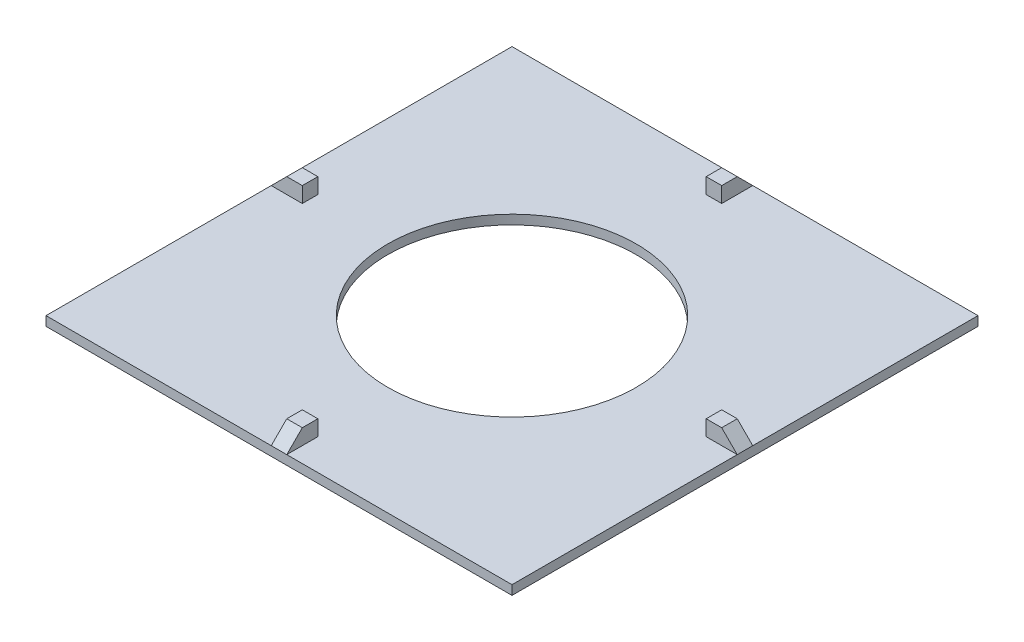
ISO-10303-21;
HEADER;
FILE_DESCRIPTION(('STEP AP214'),'2;1');
FILE_NAME('part.step','',(''),(''),'','','');
FILE_SCHEMA(('AUTOMOTIVE_DESIGN { 1 0 10303 214 1 1 1 1 }'));
ENDSEC;
DATA;
#1=APPLICATION_CONTEXT('core data for automotive mechanical design processes');
#2=APPLICATION_PROTOCOL_DEFINITION('international standard','automotive_design',2000,#1);
#3=PRODUCT_CONTEXT('',#1,'mechanical');
#4=PRODUCT('Part','Part','',(#3));
#5=PRODUCT_RELATED_PRODUCT_CATEGORY('part','',(#4));
#6=PRODUCT_DEFINITION_FORMATION('','',#4);
#7=PRODUCT_DEFINITION_CONTEXT('part definition',#1,'design');
#8=PRODUCT_DEFINITION('design','',#6,#7);
#9=PRODUCT_DEFINITION_SHAPE('','',#8);
#10=(LENGTH_UNIT() NAMED_UNIT(*) SI_UNIT(.MILLI.,.METRE.));
#11=(NAMED_UNIT(*) PLANE_ANGLE_UNIT() SI_UNIT($,.RADIAN.));
#12=(NAMED_UNIT(*) SI_UNIT($,.STERADIAN.) SOLID_ANGLE_UNIT());
#13=UNCERTAINTY_MEASURE_WITH_UNIT(LENGTH_MEASURE(1.E-05),#10,'distance_accuracy_value','');
#14=(GEOMETRIC_REPRESENTATION_CONTEXT(3) GLOBAL_UNCERTAINTY_ASSIGNED_CONTEXT((#13)) GLOBAL_UNIT_ASSIGNED_CONTEXT((#10,
#11,#12)) REPRESENTATION_CONTEXT('',''));
#15=CARTESIAN_POINT('',(0.,0.,0.));
#16=DIRECTION('',(0.,0.,1.));
#17=DIRECTION('',(1.,0.,0.));
#18=AXIS2_PLACEMENT_3D('',#15,#16,#17);
#19=CARTESIAN_POINT('',(0.,1.5,0.));
#20=DIRECTION('',(0.,1.,0.));
#21=DIRECTION('',(0.,0.,1.));
#22=AXIS2_PLACEMENT_3D('',#19,#20,#21);
#23=PLANE('',#22);
#24=CARTESIAN_POINT('',(0.,1.5,0.));
#25=DIRECTION('',(0.,1.,0.));
#26=DIRECTION('',(0.,0.,1.));
#27=AXIS2_PLACEMENT_3D('',#24,#25,#26);
#28=CIRCLE('',#27,40.);
#29=CARTESIAN_POINT('',(0.,1.5,40.));
#30=VERTEX_POINT('',#29);
#31=EDGE_CURVE('E258',#30,#30,#28,.T.);
#32=ORIENTED_EDGE('',*,*,#31,.F.);
#33=EDGE_LOOP('',(#32));
#34=FACE_BOUND('',#33,.T.);
#35=DIRECTION('',(-1.,0.,0.));
#36=VECTOR('',#35,1.);
#37=CARTESIAN_POINT('',(-2.49999999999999,1.5,65.));
#38=LINE('',#37,#36);
#39=CARTESIAN_POINT('',(2.50000000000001,1.5,65.));
#40=VERTEX_POINT('',#39);
#41=CARTESIAN_POINT('',(-2.49999999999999,1.5,65.));
#42=VERTEX_POINT('',#41);
#43=EDGE_CURVE('E207',#40,#42,#38,.T.);
#44=ORIENTED_EDGE('',*,*,#43,.F.);
#45=DIRECTION('',(0.,0.,-1.));
#46=VECTOR('',#45,1.);
#47=CARTESIAN_POINT('',(2.5,1.5,75.));
#48=LINE('',#47,#46);
#49=CARTESIAN_POINT('',(2.5,1.5,75.));
#50=VERTEX_POINT('',#49);
#51=EDGE_CURVE('E187',#50,#40,#48,.T.);
#52=ORIENTED_EDGE('',*,*,#51,.F.);
#53=DIRECTION('',(1.,0.,0.));
#54=VECTOR('',#53,1.);
#55=CARTESIAN_POINT('',(-75.,1.5,75.));
#56=LINE('',#55,#54);
#57=CARTESIAN_POINT('',(75.,1.5,75.));
#58=VERTEX_POINT('',#57);
#59=EDGE_CURVE('E194',#50,#58,#56,.T.);
#60=ORIENTED_EDGE('',*,*,#59,.T.);
#61=DIRECTION('',(0.,0.,-1.));
#62=VECTOR('',#61,1.);
#63=CARTESIAN_POINT('',(75.,1.5,-75.));
#64=LINE('',#63,#62);
#65=CARTESIAN_POINT('',(75.,1.5,2.5));
#66=VERTEX_POINT('',#65);
#67=EDGE_CURVE('E267',#58,#66,#64,.T.);
#68=ORIENTED_EDGE('',*,*,#67,.T.);
#69=DIRECTION('',(1.,0.,0.));
#70=VECTOR('',#69,1.);
#71=CARTESIAN_POINT('',(65.,1.5,2.5));
#72=LINE('',#71,#70);
#73=CARTESIAN_POINT('',(65.,1.5,2.5));
#74=VERTEX_POINT('',#73);
#75=EDGE_CURVE('E285',#74,#66,#72,.T.);
#76=ORIENTED_EDGE('',*,*,#75,.F.);
#77=DIRECTION('',(0.,0.,1.));
#78=VECTOR('',#77,1.);
#79=CARTESIAN_POINT('',(65.,1.5,-2.5));
#80=LINE('',#79,#78);
#81=CARTESIAN_POINT('',(65.,1.5,-2.5));
#82=VERTEX_POINT('',#81);
#83=EDGE_CURVE('E288',#82,#74,#80,.T.);
#84=ORIENTED_EDGE('',*,*,#83,.F.);
#85=DIRECTION('',(-1.,0.,0.));
#86=VECTOR('',#85,1.);
#87=CARTESIAN_POINT('',(65.,1.5,-2.5));
#88=LINE('',#87,#86);
#89=CARTESIAN_POINT('',(75.,1.5,-2.5));
#90=VERTEX_POINT('',#89);
#91=EDGE_CURVE('E281',#90,#82,#88,.T.);
#92=ORIENTED_EDGE('',*,*,#91,.F.);
#93=CARTESIAN_POINT('',(75.,1.5,-75.));
#94=VERTEX_POINT('',#93);
#95=EDGE_CURVE('E251',#90,#94,#64,.T.);
#96=ORIENTED_EDGE('',*,*,#95,.T.);
#97=DIRECTION('',(-1.,0.,0.));
#98=VECTOR('',#97,1.);
#99=CARTESIAN_POINT('',(-75.,1.5,-75.));
#100=LINE('',#99,#98);
#101=CARTESIAN_POINT('',(2.5,1.5,-75.));
#102=VERTEX_POINT('',#101);
#103=EDGE_CURVE('E263',#94,#102,#100,.T.);
#104=ORIENTED_EDGE('',*,*,#103,.T.);
#105=DIRECTION('',(0.,0.,-1.));
#106=VECTOR('',#105,1.);
#107=CARTESIAN_POINT('',(2.5,1.5,-75.));
#108=LINE('',#107,#106);
#109=CARTESIAN_POINT('',(2.50000000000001,1.5,-65.));
#110=VERTEX_POINT('',#109);
#111=EDGE_CURVE('E322',#110,#102,#108,.T.);
#112=ORIENTED_EDGE('',*,*,#111,.F.);
#113=DIRECTION('',(1.,0.,0.));
#114=VECTOR('',#113,1.);
#115=CARTESIAN_POINT('',(-2.49999999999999,1.5,-65.));
#116=LINE('',#115,#114);
#117=CARTESIAN_POINT('',(-2.49999999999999,1.5,-65.));
#118=VERTEX_POINT('',#117);
#119=EDGE_CURVE('E331',#118,#110,#116,.T.);
#120=ORIENTED_EDGE('',*,*,#119,.F.);
#121=DIRECTION('',(0.,0.,1.));
#122=VECTOR('',#121,1.);
#123=CARTESIAN_POINT('',(-2.5,1.5,-75.));
#124=LINE('',#123,#122);
#125=CARTESIAN_POINT('',(-2.5,1.5,-75.));
#126=VERTEX_POINT('',#125);
#127=EDGE_CURVE('E319',#126,#118,#124,.T.);
#128=ORIENTED_EDGE('',*,*,#127,.F.);
#129=CARTESIAN_POINT('',(-75.,1.5,-75.));
#130=VERTEX_POINT('',#129);
#131=EDGE_CURVE('E266',#126,#130,#100,.T.);
#132=ORIENTED_EDGE('',*,*,#131,.T.);
#133=DIRECTION('',(0.,0.,1.));
#134=VECTOR('',#133,1.);
#135=CARTESIAN_POINT('',(-75.,1.5,-75.));
#136=LINE('',#135,#134);
#137=CARTESIAN_POINT('',(-75.,1.5,-2.5));
#138=VERTEX_POINT('',#137);
#139=EDGE_CURVE('E204',#130,#138,#136,.T.);
#140=ORIENTED_EDGE('',*,*,#139,.T.);
#141=DIRECTION('',(-1.,0.,0.));
#142=VECTOR('',#141,1.);
#143=CARTESIAN_POINT('',(-75.,1.5,-2.5));
#144=LINE('',#143,#142);
#145=CARTESIAN_POINT('',(-65.,1.5,-2.5));
#146=VERTEX_POINT('',#145);
#147=EDGE_CURVE('E300',#146,#138,#144,.T.);
#148=ORIENTED_EDGE('',*,*,#147,.F.);
#149=DIRECTION('',(0.,0.,-1.));
#150=VECTOR('',#149,1.);
#151=CARTESIAN_POINT('',(-65.,1.5,2.5));
#152=LINE('',#151,#150);
#153=CARTESIAN_POINT('',(-65.,1.5,2.5));
#154=VERTEX_POINT('',#153);
#155=EDGE_CURVE('E309',#154,#146,#152,.T.);
#156=ORIENTED_EDGE('',*,*,#155,.F.);
#157=DIRECTION('',(1.,0.,0.));
#158=VECTOR('',#157,1.);
#159=CARTESIAN_POINT('',(-75.,1.5,2.5));
#160=LINE('',#159,#158);
#161=CARTESIAN_POINT('',(-75.,1.5,2.5));
#162=VERTEX_POINT('',#161);
#163=EDGE_CURVE('E291',#162,#154,#160,.T.);
#164=ORIENTED_EDGE('',*,*,#163,.F.);
#165=CARTESIAN_POINT('',(-75.,1.5,75.));
#166=VERTEX_POINT('',#165);
#167=EDGE_CURVE('E262',#162,#166,#136,.T.);
#168=ORIENTED_EDGE('',*,*,#167,.T.);
#169=CARTESIAN_POINT('',(-2.5,1.5,75.));
#170=VERTEX_POINT('',#169);
#171=EDGE_CURVE('E203',#166,#170,#56,.T.);
#172=ORIENTED_EDGE('',*,*,#171,.T.);
#173=DIRECTION('',(0.,0.,1.));
#174=VECTOR('',#173,1.);
#175=CARTESIAN_POINT('',(-2.5,1.5,75.));
#176=LINE('',#175,#174);
#177=EDGE_CURVE('E341',#42,#170,#176,.T.);
#178=ORIENTED_EDGE('',*,*,#177,.F.);
#179=EDGE_LOOP('',(#44,#52,#60,#68,#76,#84,#92,#96,#104,#112,#120,#128,#132,#140,#148,#156,#164,
#168,#172,#178));
#180=FACE_BOUND('',#179,.T.);
#181=ADVANCED_FACE('F44',(#34,#180),#23,.T.);
#182=CARTESIAN_POINT('',(0.,-1.5,0.));
#183=DIRECTION('',(0.,1.,0.));
#184=DIRECTION('',(0.,0.,1.));
#185=AXIS2_PLACEMENT_3D('',#182,#183,#184);
#186=PLANE('',#185);
#187=DIRECTION('',(0.,0.,-1.));
#188=VECTOR('',#187,1.);
#189=CARTESIAN_POINT('',(75.,-1.5,-75.));
#190=LINE('',#189,#188);
#191=CARTESIAN_POINT('',(75.,-1.5,75.));
#192=VERTEX_POINT('',#191);
#193=CARTESIAN_POINT('',(75.,-1.5,-75.));
#194=VERTEX_POINT('',#193);
#195=EDGE_CURVE('E256',#192,#194,#190,.T.);
#196=ORIENTED_EDGE('',*,*,#195,.F.);
#197=DIRECTION('',(1.,0.,0.));
#198=VECTOR('',#197,1.);
#199=CARTESIAN_POINT('',(-75.,-1.5,75.));
#200=LINE('',#199,#198);
#201=CARTESIAN_POINT('',(-75.,-1.5,75.));
#202=VERTEX_POINT('',#201);
#203=EDGE_CURVE('E249',#202,#192,#200,.T.);
#204=ORIENTED_EDGE('',*,*,#203,.F.);
#205=DIRECTION('',(0.,0.,1.));
#206=VECTOR('',#205,1.);
#207=CARTESIAN_POINT('',(-75.,-1.5,-75.));
#208=LINE('',#207,#206);
#209=CARTESIAN_POINT('',(-75.,-1.5,-75.));
#210=VERTEX_POINT('',#209);
#211=EDGE_CURVE('E252',#210,#202,#208,.T.);
#212=ORIENTED_EDGE('',*,*,#211,.F.);
#213=DIRECTION('',(-1.,0.,0.));
#214=VECTOR('',#213,1.);
#215=CARTESIAN_POINT('',(-75.,-1.5,-75.));
#216=LINE('',#215,#214);
#217=EDGE_CURVE('E254',#194,#210,#216,.T.);
#218=ORIENTED_EDGE('',*,*,#217,.F.);
#219=EDGE_LOOP('',(#196,#204,#212,#218));
#220=FACE_BOUND('',#219,.T.);
#221=CARTESIAN_POINT('',(0.,-1.5,0.));
#222=DIRECTION('',(0.,1.,0.));
#223=DIRECTION('',(0.,0.,1.));
#224=AXIS2_PLACEMENT_3D('',#221,#222,#223);
#225=CIRCLE('',#224,40.);
#226=CARTESIAN_POINT('',(0.,-1.5,40.));
#227=VERTEX_POINT('',#226);
#228=EDGE_CURVE('E269',#227,#227,#225,.T.);
#229=ORIENTED_EDGE('',*,*,#228,.T.);
#230=EDGE_LOOP('',(#229));
#231=FACE_BOUND('',#230,.T.);
#232=ADVANCED_FACE('F367',(#220,#231),#186,.F.);
#233=CARTESIAN_POINT('',(75.,1.5,-75.));
#234=DIRECTION('',(-1.,0.,0.));
#235=DIRECTION('',(0.,0.,1.));
#236=AXIS2_PLACEMENT_3D('',#233,#234,#235);
#237=PLANE('',#236);
#238=ORIENTED_EDGE('',*,*,#95,.F.);
#239=DIRECTION('',(0.,0.,1.));
#240=VECTOR('',#239,1.);
#241=CARTESIAN_POINT('',(75.,1.50000000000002,2.5));
#242=LINE('',#241,#240);
#243=EDGE_CURVE('E214',#90,#66,#242,.T.);
#244=ORIENTED_EDGE('',*,*,#243,.T.);
#245=ORIENTED_EDGE('',*,*,#67,.F.);
#246=DIRECTION('',(0.,-1.,0.));
#247=VECTOR('',#246,1.);
#248=CARTESIAN_POINT('',(75.,1.5,75.));
#249=LINE('',#248,#247);
#250=EDGE_CURVE('E199',#58,#192,#249,.T.);
#251=ORIENTED_EDGE('',*,*,#250,.T.);
#252=ORIENTED_EDGE('',*,*,#195,.T.);
#253=DIRECTION('',(0.,-1.,0.));
#254=VECTOR('',#253,1.);
#255=CARTESIAN_POINT('',(75.,1.5,-75.));
#256=LINE('',#255,#254);
#257=EDGE_CURVE('E239',#94,#194,#256,.T.);
#258=ORIENTED_EDGE('',*,*,#257,.F.);
#259=EDGE_LOOP('',(#238,#244,#245,#251,#252,#258));
#260=FACE_BOUND('',#259,.T.);
#261=ADVANCED_FACE('F372',(#260),#237,.F.);
#262=CARTESIAN_POINT('',(-75.,1.5,-75.));
#263=DIRECTION('',(0.,0.,1.));
#264=DIRECTION('',(1.,0.,0.));
#265=AXIS2_PLACEMENT_3D('',#262,#263,#264);
#266=PLANE('',#265);
#267=ORIENTED_EDGE('',*,*,#131,.F.);
#268=DIRECTION('',(1.,0.,0.));
#269=VECTOR('',#268,1.);
#270=CARTESIAN_POINT('',(2.5,1.5,-75.));
#271=LINE('',#270,#269);
#272=EDGE_CURVE('E223',#126,#102,#271,.T.);
#273=ORIENTED_EDGE('',*,*,#272,.T.);
#274=ORIENTED_EDGE('',*,*,#103,.F.);
#275=ORIENTED_EDGE('',*,*,#257,.T.);
#276=ORIENTED_EDGE('',*,*,#217,.T.);
#277=DIRECTION('',(0.,-1.,0.));
#278=VECTOR('',#277,1.);
#279=CARTESIAN_POINT('',(-75.,1.5,-75.));
#280=LINE('',#279,#278);
#281=EDGE_CURVE('E242',#130,#210,#280,.T.);
#282=ORIENTED_EDGE('',*,*,#281,.F.);
#283=EDGE_LOOP('',(#267,#273,#274,#275,#276,#282));
#284=FACE_BOUND('',#283,.T.);
#285=ADVANCED_FACE('F394',(#284),#266,.F.);
#286=CARTESIAN_POINT('',(-75.,1.5,-75.));
#287=DIRECTION('',(1.,0.,0.));
#288=DIRECTION('',(0.,0.,-1.));
#289=AXIS2_PLACEMENT_3D('',#286,#287,#288);
#290=PLANE('',#289);
#291=ORIENTED_EDGE('',*,*,#167,.F.);
#292=DIRECTION('',(0.,0.,-1.));
#293=VECTOR('',#292,1.);
#294=CARTESIAN_POINT('',(-75.,1.49999999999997,-75.));
#295=LINE('',#294,#293);
#296=EDGE_CURVE('E232',#162,#138,#295,.T.);
#297=ORIENTED_EDGE('',*,*,#296,.T.);
#298=ORIENTED_EDGE('',*,*,#139,.F.);
#299=ORIENTED_EDGE('',*,*,#281,.T.);
#300=ORIENTED_EDGE('',*,*,#211,.T.);
#301=DIRECTION('',(0.,-1.,0.));
#302=VECTOR('',#301,1.);
#303=CARTESIAN_POINT('',(-75.,1.5,75.));
#304=LINE('',#303,#302);
#305=EDGE_CURVE('E245',#166,#202,#304,.T.);
#306=ORIENTED_EDGE('',*,*,#305,.F.);
#307=EDGE_LOOP('',(#291,#297,#298,#299,#300,#306));
#308=FACE_BOUND('',#307,.T.);
#309=ADVANCED_FACE('F441',(#308),#290,.F.);
#310=CARTESIAN_POINT('',(-75.,1.5,75.));
#311=DIRECTION('',(0.,0.,-1.));
#312=DIRECTION('',(-1.,0.,0.));
#313=AXIS2_PLACEMENT_3D('',#310,#311,#312);
#314=PLANE('',#313);
#315=ORIENTED_EDGE('',*,*,#59,.F.);
#316=DIRECTION('',(-1.,0.,0.));
#317=VECTOR('',#316,1.);
#318=CARTESIAN_POINT('',(-2.5,1.49999999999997,75.));
#319=LINE('',#318,#317);
#320=EDGE_CURVE('E53',#50,#170,#319,.T.);
#321=ORIENTED_EDGE('',*,*,#320,.T.);
#322=ORIENTED_EDGE('',*,*,#171,.F.);
#323=ORIENTED_EDGE('',*,*,#305,.T.);
#324=ORIENTED_EDGE('',*,*,#203,.T.);
#325=ORIENTED_EDGE('',*,*,#250,.F.);
#326=EDGE_LOOP('',(#315,#321,#322,#323,#324,#325));
#327=FACE_BOUND('',#326,.T.);
#328=ADVANCED_FACE('F195',(#327),#314,.F.);
#329=CARTESIAN_POINT('',(0.,1.5,0.));
#330=DIRECTION('',(0.,-1.,0.));
#331=DIRECTION('',(0.,0.,-1.));
#332=AXIS2_PLACEMENT_3D('',#329,#330,#331);
#333=CYLINDRICAL_SURFACE('',#332,40.);
#334=ORIENTED_EDGE('',*,*,#31,.T.);
#335=EDGE_LOOP('',(#334));
#336=FACE_BOUND('',#335,.T.);
#337=ORIENTED_EDGE('',*,*,#228,.F.);
#338=EDGE_LOOP('',(#337));
#339=FACE_BOUND('',#338,.T.);
#340=ADVANCED_FACE('F436',(#336,#339),#333,.F.);
#341=CARTESIAN_POINT('',(65.,6.5,-2.5));
#342=DIRECTION('',(1.,0.,0.));
#343=DIRECTION('',(0.,0.,-1.));
#344=AXIS2_PLACEMENT_3D('',#341,#342,#343);
#345=PLANE('',#344);
#346=ORIENTED_EDGE('',*,*,#83,.T.);
#347=DIRECTION('',(0.,-1.,0.));
#348=VECTOR('',#347,1.);
#349=CARTESIAN_POINT('',(65.,6.5,2.5));
#350=LINE('',#349,#348);
#351=CARTESIAN_POINT('',(65.,6.5,2.5));
#352=VERTEX_POINT('',#351);
#353=EDGE_CURVE('E272',#352,#74,#350,.T.);
#354=ORIENTED_EDGE('',*,*,#353,.F.);
#355=DIRECTION('',(0.,0.,1.));
#356=VECTOR('',#355,1.);
#357=CARTESIAN_POINT('',(65.,6.5,-2.5));
#358=LINE('',#357,#356);
#359=CARTESIAN_POINT('',(65.,6.5,-2.5));
#360=VERTEX_POINT('',#359);
#361=EDGE_CURVE('E284',#360,#352,#358,.T.);
#362=ORIENTED_EDGE('',*,*,#361,.F.);
#363=DIRECTION('',(0.,-1.,0.));
#364=VECTOR('',#363,1.);
#365=CARTESIAN_POINT('',(65.,6.5,-2.5));
#366=LINE('',#365,#364);
#367=EDGE_CURVE('E277',#360,#82,#366,.T.);
#368=ORIENTED_EDGE('',*,*,#367,.T.);
#369=EDGE_LOOP('',(#346,#354,#362,#368));
#370=FACE_BOUND('',#369,.T.);
#371=ADVANCED_FACE('F390',(#370),#345,.F.);
#372=CARTESIAN_POINT('',(65.,6.5,2.5));
#373=DIRECTION('',(0.,0.,-1.));
#374=DIRECTION('',(-1.,0.,0.));
#375=AXIS2_PLACEMENT_3D('',#372,#373,#374);
#376=PLANE('',#375);
#377=ORIENTED_EDGE('',*,*,#75,.T.);
#378=DIRECTION('',(-0.707106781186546,0.707106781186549,0.));
#379=VECTOR('',#378,1.);
#380=CARTESIAN_POINT('',(70.0000000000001,6.5,2.5));
#381=LINE('',#380,#379);
#382=CARTESIAN_POINT('',(70.0000000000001,6.5,2.5));
#383=VERTEX_POINT('',#382);
#384=EDGE_CURVE('E212',#66,#383,#381,.T.);
#385=ORIENTED_EDGE('',*,*,#384,.T.);
#386=DIRECTION('',(1.,0.,0.));
#387=VECTOR('',#386,1.);
#388=CARTESIAN_POINT('',(65.,6.5,2.5));
#389=LINE('',#388,#387);
#390=EDGE_CURVE('E293',#352,#383,#389,.T.);
#391=ORIENTED_EDGE('',*,*,#390,.F.);
#392=ORIENTED_EDGE('',*,*,#353,.T.);
#393=EDGE_LOOP('',(#377,#385,#391,#392));
#394=FACE_BOUND('',#393,.T.);
#395=ADVANCED_FACE('F376',(#394),#376,.F.);
#396=CARTESIAN_POINT('',(65.,6.5,-2.5));
#397=DIRECTION('',(0.,0.,1.));
#398=DIRECTION('',(1.,0.,0.));
#399=AXIS2_PLACEMENT_3D('',#396,#397,#398);
#400=PLANE('',#399);
#401=DIRECTION('',(-1.,0.,0.));
#402=VECTOR('',#401,1.);
#403=CARTESIAN_POINT('',(65.,6.5,-2.5));
#404=LINE('',#403,#402);
#405=CARTESIAN_POINT('',(70.0000000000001,6.5,-2.5));
#406=VERTEX_POINT('',#405);
#407=EDGE_CURVE('E280',#406,#360,#404,.T.);
#408=ORIENTED_EDGE('',*,*,#407,.F.);
#409=DIRECTION('',(0.707106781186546,-0.707106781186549,0.));
#410=VECTOR('',#409,1.);
#411=CARTESIAN_POINT('',(70.0000000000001,6.5,-2.5));
#412=LINE('',#411,#410);
#413=EDGE_CURVE('E216',#406,#90,#412,.T.);
#414=ORIENTED_EDGE('',*,*,#413,.T.);
#415=ORIENTED_EDGE('',*,*,#91,.T.);
#416=ORIENTED_EDGE('',*,*,#367,.F.);
#417=EDGE_LOOP('',(#408,#414,#415,#416));
#418=FACE_BOUND('',#417,.T.);
#419=ADVANCED_FACE('F386',(#418),#400,.F.);
#420=CARTESIAN_POINT('',(0.,6.5,0.));
#421=DIRECTION('',(0.,1.,0.));
#422=DIRECTION('',(0.,0.,1.));
#423=AXIS2_PLACEMENT_3D('',#420,#421,#422);
#424=PLANE('',#423);
#425=ORIENTED_EDGE('',*,*,#390,.T.);
#426=DIRECTION('',(0.,0.,-1.));
#427=VECTOR('',#426,1.);
#428=CARTESIAN_POINT('',(70.0000000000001,6.5,-2.5));
#429=LINE('',#428,#427);
#430=EDGE_CURVE('E218',#383,#406,#429,.T.);
#431=ORIENTED_EDGE('',*,*,#430,.T.);
#432=ORIENTED_EDGE('',*,*,#407,.T.);
#433=ORIENTED_EDGE('',*,*,#361,.T.);
#434=EDGE_LOOP('',(#425,#431,#432,#433));
#435=FACE_BOUND('',#434,.T.);
#436=ADVANCED_FACE('F383',(#435),#424,.T.);
#437=CARTESIAN_POINT('',(-75.,6.5,2.5));
#438=DIRECTION('',(0.,0.,-1.));
#439=DIRECTION('',(-1.,0.,0.));
#440=AXIS2_PLACEMENT_3D('',#437,#438,#439);
#441=PLANE('',#440);
#442=DIRECTION('',(1.,0.,0.));
#443=VECTOR('',#442,1.);
#444=CARTESIAN_POINT('',(-75.,6.5,2.5));
#445=LINE('',#444,#443);
#446=CARTESIAN_POINT('',(-70.,6.5,2.5));
#447=VERTEX_POINT('',#446);
#448=CARTESIAN_POINT('',(-65.,6.5,2.5));
#449=VERTEX_POINT('',#448);
#450=EDGE_CURVE('E298',#447,#449,#445,.T.);
#451=ORIENTED_EDGE('',*,*,#450,.F.);
#452=DIRECTION('',(0.707106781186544,0.707106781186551,0.));
#453=VECTOR('',#452,1.);
#454=CARTESIAN_POINT('',(-70.,6.5,2.5));
#455=LINE('',#454,#453);
#456=EDGE_CURVE('E234',#447,#162,#455,.F.);
#457=ORIENTED_EDGE('',*,*,#456,.T.);
#458=ORIENTED_EDGE('',*,*,#163,.T.);
#459=DIRECTION('',(0.,-1.,0.));
#460=VECTOR('',#459,1.);
#461=CARTESIAN_POINT('',(-65.,6.5,2.5));
#462=LINE('',#461,#460);
#463=EDGE_CURVE('E316',#449,#154,#462,.T.);
#464=ORIENTED_EDGE('',*,*,#463,.F.);
#465=EDGE_LOOP('',(#451,#457,#458,#464));
#466=FACE_BOUND('',#465,.T.);
#467=ADVANCED_FACE('F565',(#466),#441,.F.);
#468=CARTESIAN_POINT('',(-65.,6.5,2.5));
#469=DIRECTION('',(-1.,0.,0.));
#470=DIRECTION('',(0.,0.,1.));
#471=AXIS2_PLACEMENT_3D('',#468,#469,#470);
#472=PLANE('',#471);
#473=ORIENTED_EDGE('',*,*,#155,.T.);
#474=DIRECTION('',(0.,-1.,0.));
#475=VECTOR('',#474,1.);
#476=CARTESIAN_POINT('',(-65.,6.5,-2.5));
#477=LINE('',#476,#475);
#478=CARTESIAN_POINT('',(-65.,6.5,-2.5));
#479=VERTEX_POINT('',#478);
#480=EDGE_CURVE('E306',#479,#146,#477,.T.);
#481=ORIENTED_EDGE('',*,*,#480,.F.);
#482=DIRECTION('',(0.,0.,-1.));
#483=VECTOR('',#482,1.);
#484=CARTESIAN_POINT('',(-65.,6.5,2.5));
#485=LINE('',#484,#483);
#486=EDGE_CURVE('E301',#449,#479,#485,.T.);
#487=ORIENTED_EDGE('',*,*,#486,.F.);
#488=ORIENTED_EDGE('',*,*,#463,.T.);
#489=EDGE_LOOP('',(#473,#481,#487,#488));
#490=FACE_BOUND('',#489,.T.);
#491=ADVANCED_FACE('F556',(#490),#472,.F.);
#492=CARTESIAN_POINT('',(-75.,6.5,-2.5));
#493=DIRECTION('',(0.,0.,1.));
#494=DIRECTION('',(1.,0.,0.));
#495=AXIS2_PLACEMENT_3D('',#492,#493,#494);
#496=PLANE('',#495);
#497=ORIENTED_EDGE('',*,*,#147,.T.);
#498=DIRECTION('',(-0.707106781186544,-0.707106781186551,0.));
#499=VECTOR('',#498,1.);
#500=CARTESIAN_POINT('',(-70.,6.5,-2.5));
#501=LINE('',#500,#499);
#502=CARTESIAN_POINT('',(-70.,6.5,-2.5));
#503=VERTEX_POINT('',#502);
#504=EDGE_CURVE('E230',#138,#503,#501,.F.);
#505=ORIENTED_EDGE('',*,*,#504,.T.);
#506=DIRECTION('',(-1.,0.,0.));
#507=VECTOR('',#506,1.);
#508=CARTESIAN_POINT('',(-75.,6.5,-2.5));
#509=LINE('',#508,#507);
#510=EDGE_CURVE('E303',#479,#503,#509,.T.);
#511=ORIENTED_EDGE('',*,*,#510,.F.);
#512=ORIENTED_EDGE('',*,*,#480,.T.);
#513=EDGE_LOOP('',(#497,#505,#511,#512));
#514=FACE_BOUND('',#513,.T.);
#515=ADVANCED_FACE('F423',(#514),#496,.F.);
#516=CARTESIAN_POINT('',(0.,6.5,0.));
#517=DIRECTION('',(0.,-1.,0.));
#518=DIRECTION('',(0.,0.,-1.));
#519=AXIS2_PLACEMENT_3D('',#516,#517,#518);
#520=PLANE('',#519);
#521=ORIENTED_EDGE('',*,*,#510,.T.);
#522=DIRECTION('',(0.,0.,1.));
#523=VECTOR('',#522,1.);
#524=CARTESIAN_POINT('',(-70.,6.5,0.));
#525=LINE('',#524,#523);
#526=EDGE_CURVE('E236',#503,#447,#525,.T.);
#527=ORIENTED_EDGE('',*,*,#526,.T.);
#528=ORIENTED_EDGE('',*,*,#450,.T.);
#529=ORIENTED_EDGE('',*,*,#486,.T.);
#530=EDGE_LOOP('',(#521,#527,#528,#529));
#531=FACE_BOUND('',#530,.T.);
#532=ADVANCED_FACE('F416',(#531),#520,.F.);
#533=CARTESIAN_POINT('',(-2.5,6.5,-75.));
#534=DIRECTION('',(1.,0.,0.));
#535=DIRECTION('',(0.,0.,-1.));
#536=AXIS2_PLACEMENT_3D('',#533,#534,#535);
#537=PLANE('',#536);
#538=DIRECTION('',(0.,0.,1.));
#539=VECTOR('',#538,1.);
#540=CARTESIAN_POINT('',(-2.5,6.5,-75.));
#541=LINE('',#540,#539);
#542=CARTESIAN_POINT('',(-2.5,6.5,-70.));
#543=VERTEX_POINT('',#542);
#544=CARTESIAN_POINT('',(-2.49999999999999,6.5,-65.));
#545=VERTEX_POINT('',#544);
#546=EDGE_CURVE('E320',#543,#545,#541,.T.);
#547=ORIENTED_EDGE('',*,*,#546,.F.);
#548=DIRECTION('',(0.,-0.707106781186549,-0.707106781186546));
#549=VECTOR('',#548,1.);
#550=CARTESIAN_POINT('',(-2.5,6.5,-70.));
#551=LINE('',#550,#549);
#552=EDGE_CURVE('E225',#543,#126,#551,.T.);
#553=ORIENTED_EDGE('',*,*,#552,.T.);
#554=ORIENTED_EDGE('',*,*,#127,.T.);
#555=DIRECTION('',(0.,-1.,0.));
#556=VECTOR('',#555,1.);
#557=CARTESIAN_POINT('',(-2.49999999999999,6.5,-65.));
#558=LINE('',#557,#556);
#559=EDGE_CURVE('E208',#545,#118,#558,.T.);
#560=ORIENTED_EDGE('',*,*,#559,.F.);
#561=EDGE_LOOP('',(#547,#553,#554,#560));
#562=FACE_BOUND('',#561,.T.);
#563=ADVANCED_FACE('F414',(#562),#537,.F.);
#564=CARTESIAN_POINT('',(-2.49999999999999,6.5,-65.));
#565=DIRECTION('',(0.,0.,-1.));
#566=DIRECTION('',(-1.,0.,0.));
#567=AXIS2_PLACEMENT_3D('',#564,#565,#566);
#568=PLANE('',#567);
#569=ORIENTED_EDGE('',*,*,#119,.T.);
#570=DIRECTION('',(0.,-1.,0.));
#571=VECTOR('',#570,1.);
#572=CARTESIAN_POINT('',(2.50000000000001,6.5,-65.));
#573=LINE('',#572,#571);
#574=CARTESIAN_POINT('',(2.50000000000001,6.5,-65.));
#575=VERTEX_POINT('',#574);
#576=EDGE_CURVE('E328',#575,#110,#573,.T.);
#577=ORIENTED_EDGE('',*,*,#576,.F.);
#578=DIRECTION('',(1.,0.,0.));
#579=VECTOR('',#578,1.);
#580=CARTESIAN_POINT('',(-2.49999999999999,6.5,-65.));
#581=LINE('',#580,#579);
#582=EDGE_CURVE('E323',#545,#575,#581,.T.);
#583=ORIENTED_EDGE('',*,*,#582,.F.);
#584=ORIENTED_EDGE('',*,*,#559,.T.);
#585=EDGE_LOOP('',(#569,#577,#583,#584));
#586=FACE_BOUND('',#585,.T.);
#587=ADVANCED_FACE('F412',(#586),#568,.F.);
#588=CARTESIAN_POINT('',(2.5,6.5,-75.));
#589=DIRECTION('',(-1.,0.,0.));
#590=DIRECTION('',(0.,0.,1.));
#591=AXIS2_PLACEMENT_3D('',#588,#589,#590);
#592=PLANE('',#591);
#593=ORIENTED_EDGE('',*,*,#111,.T.);
#594=DIRECTION('',(0.,0.707106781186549,0.707106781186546));
#595=VECTOR('',#594,1.);
#596=CARTESIAN_POINT('',(2.5,6.5,-70.));
#597=LINE('',#596,#595);
#598=CARTESIAN_POINT('',(2.5,6.5,-70.));
#599=VERTEX_POINT('',#598);
#600=EDGE_CURVE('E221',#102,#599,#597,.T.);
#601=ORIENTED_EDGE('',*,*,#600,.T.);
#602=DIRECTION('',(0.,0.,-1.));
#603=VECTOR('',#602,1.);
#604=CARTESIAN_POINT('',(2.5,6.5,-75.));
#605=LINE('',#604,#603);
#606=EDGE_CURVE('E325',#575,#599,#605,.T.);
#607=ORIENTED_EDGE('',*,*,#606,.F.);
#608=ORIENTED_EDGE('',*,*,#576,.T.);
#609=EDGE_LOOP('',(#593,#601,#607,#608));
#610=FACE_BOUND('',#609,.T.);
#611=ADVANCED_FACE('F404',(#610),#592,.F.);
#612=CARTESIAN_POINT('',(0.,6.5,0.));
#613=DIRECTION('',(0.,1.,0.));
#614=DIRECTION('',(0.,0.,1.));
#615=AXIS2_PLACEMENT_3D('',#612,#613,#614);
#616=PLANE('',#615);
#617=ORIENTED_EDGE('',*,*,#606,.T.);
#618=DIRECTION('',(-1.,0.,0.));
#619=VECTOR('',#618,1.);
#620=CARTESIAN_POINT('',(-2.5,6.5,-70.));
#621=LINE('',#620,#619);
#622=EDGE_CURVE('E227',#599,#543,#621,.T.);
#623=ORIENTED_EDGE('',*,*,#622,.T.);
#624=ORIENTED_EDGE('',*,*,#546,.T.);
#625=ORIENTED_EDGE('',*,*,#582,.T.);
#626=EDGE_LOOP('',(#617,#623,#624,#625));
#627=FACE_BOUND('',#626,.T.);
#628=ADVANCED_FACE('F406',(#627),#616,.T.);
#629=CARTESIAN_POINT('',(2.5,6.5,75.));
#630=DIRECTION('',(-1.,0.,0.));
#631=DIRECTION('',(0.,0.,1.));
#632=AXIS2_PLACEMENT_3D('',#629,#630,#631);
#633=PLANE('',#632);
#634=DIRECTION('',(0.,0.,-1.));
#635=VECTOR('',#634,1.);
#636=CARTESIAN_POINT('',(2.5,6.5,75.));
#637=LINE('',#636,#635);
#638=CARTESIAN_POINT('',(2.5,6.5,70.));
#639=VERTEX_POINT('',#638);
#640=CARTESIAN_POINT('',(2.50000000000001,6.5,65.));
#641=VERTEX_POINT('',#640);
#642=EDGE_CURVE('E189',#639,#641,#637,.T.);
#643=ORIENTED_EDGE('',*,*,#642,.F.);
#644=DIRECTION('',(0.,-0.707106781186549,0.707106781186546));
#645=VECTOR('',#644,1.);
#646=CARTESIAN_POINT('',(2.5,6.5,70.));
#647=LINE('',#646,#645);
#648=EDGE_CURVE('E66',#639,#50,#647,.T.);
#649=ORIENTED_EDGE('',*,*,#648,.T.);
#650=ORIENTED_EDGE('',*,*,#51,.T.);
#651=DIRECTION('',(0.,-1.,0.));
#652=VECTOR('',#651,1.);
#653=CARTESIAN_POINT('',(2.50000000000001,6.5,65.));
#654=LINE('',#653,#652);
#655=EDGE_CURVE('E351',#641,#40,#654,.T.);
#656=ORIENTED_EDGE('',*,*,#655,.F.);
#657=EDGE_LOOP('',(#643,#649,#650,#656));
#658=FACE_BOUND('',#657,.T.);
#659=ADVANCED_FACE('F184',(#658),#633,.F.);
#660=CARTESIAN_POINT('',(-2.49999999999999,6.5,65.));
#661=DIRECTION('',(0.,0.,1.));
#662=DIRECTION('',(1.,0.,0.));
#663=AXIS2_PLACEMENT_3D('',#660,#661,#662);
#664=PLANE('',#663);
#665=ORIENTED_EDGE('',*,*,#43,.T.);
#666=DIRECTION('',(0.,-1.,0.));
#667=VECTOR('',#666,1.);
#668=CARTESIAN_POINT('',(-2.49999999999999,6.5,65.));
#669=LINE('',#668,#667);
#670=CARTESIAN_POINT('',(-2.49999999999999,6.5,65.));
#671=VERTEX_POINT('',#670);
#672=EDGE_CURVE('E345',#671,#42,#669,.T.);
#673=ORIENTED_EDGE('',*,*,#672,.F.);
#674=DIRECTION('',(-1.,0.,0.));
#675=VECTOR('',#674,1.);
#676=CARTESIAN_POINT('',(-2.49999999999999,6.5,65.));
#677=LINE('',#676,#675);
#678=EDGE_CURVE('E342',#641,#671,#677,.T.);
#679=ORIENTED_EDGE('',*,*,#678,.F.);
#680=ORIENTED_EDGE('',*,*,#655,.T.);
#681=EDGE_LOOP('',(#665,#673,#679,#680));
#682=FACE_BOUND('',#681,.T.);
#683=ADVANCED_FACE('F354',(#682),#664,.F.);
#684=CARTESIAN_POINT('',(-2.5,6.5,75.));
#685=DIRECTION('',(1.,0.,0.));
#686=DIRECTION('',(0.,0.,-1.));
#687=AXIS2_PLACEMENT_3D('',#684,#685,#686);
#688=PLANE('',#687);
#689=ORIENTED_EDGE('',*,*,#177,.T.);
#690=DIRECTION('',(0.,0.707106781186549,-0.707106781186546));
#691=VECTOR('',#690,1.);
#692=CARTESIAN_POINT('',(-2.5,6.5,70.));
#693=LINE('',#692,#691);
#694=CARTESIAN_POINT('',(-2.5,6.5,70.));
#695=VERTEX_POINT('',#694);
#696=EDGE_CURVE('E11',#170,#695,#693,.T.);
#697=ORIENTED_EDGE('',*,*,#696,.T.);
#698=DIRECTION('',(0.,0.,1.));
#699=VECTOR('',#698,1.);
#700=CARTESIAN_POINT('',(-2.5,6.5,75.));
#701=LINE('',#700,#699);
#702=EDGE_CURVE('E344',#671,#695,#701,.T.);
#703=ORIENTED_EDGE('',*,*,#702,.F.);
#704=ORIENTED_EDGE('',*,*,#672,.T.);
#705=EDGE_LOOP('',(#689,#697,#703,#704));
#706=FACE_BOUND('',#705,.T.);
#707=ADVANCED_FACE('F358',(#706),#688,.F.);
#708=CARTESIAN_POINT('',(0.,6.5,0.));
#709=DIRECTION('',(0.,1.,0.));
#710=DIRECTION('',(0.,0.,1.));
#711=AXIS2_PLACEMENT_3D('',#708,#709,#710);
#712=PLANE('',#711);
#713=ORIENTED_EDGE('',*,*,#702,.T.);
#714=DIRECTION('',(1.,0.,0.));
#715=VECTOR('',#714,1.);
#716=CARTESIAN_POINT('',(2.5,6.5,70.));
#717=LINE('',#716,#715);
#718=EDGE_CURVE('E190',#695,#639,#717,.T.);
#719=ORIENTED_EDGE('',*,*,#718,.T.);
#720=ORIENTED_EDGE('',*,*,#642,.T.);
#721=ORIENTED_EDGE('',*,*,#678,.T.);
#722=EDGE_LOOP('',(#713,#719,#720,#721));
#723=FACE_BOUND('',#722,.T.);
#724=ADVANCED_FACE('F357',(#723),#712,.T.);
#725=CARTESIAN_POINT('',(-70.,6.5,0.));
#726=DIRECTION('',(0.707106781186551,-0.707106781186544,0.));
#727=DIRECTION('',(0.,0.,1.));
#728=AXIS2_PLACEMENT_3D('',#725,#726,#727);
#729=PLANE('',#728);
#730=ORIENTED_EDGE('',*,*,#504,.F.);
#731=ORIENTED_EDGE('',*,*,#296,.F.);
#732=ORIENTED_EDGE('',*,*,#456,.F.);
#733=ORIENTED_EDGE('',*,*,#526,.F.);
#734=EDGE_LOOP('',(#730,#731,#732,#733));
#735=FACE_BOUND('',#734,.T.);
#736=ADVANCED_FACE('F449',(#735),#729,.F.);
#737=CARTESIAN_POINT('',(0.,6.5,-70.));
#738=DIRECTION('',(0.,0.707106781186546,-0.707106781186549));
#739=DIRECTION('',(1.,0.,0.));
#740=AXIS2_PLACEMENT_3D('',#737,#738,#739);
#741=PLANE('',#740);
#742=ORIENTED_EDGE('',*,*,#600,.F.);
#743=ORIENTED_EDGE('',*,*,#272,.F.);
#744=ORIENTED_EDGE('',*,*,#552,.F.);
#745=ORIENTED_EDGE('',*,*,#622,.F.);
#746=EDGE_LOOP('',(#742,#743,#744,#745));
#747=FACE_BOUND('',#746,.T.);
#748=ADVANCED_FACE('F400',(#747),#741,.T.);
#749=CARTESIAN_POINT('',(70.0000000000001,6.5,0.));
#750=DIRECTION('',(0.707106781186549,0.707106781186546,0.));
#751=DIRECTION('',(0.,0.,1.));
#752=AXIS2_PLACEMENT_3D('',#749,#750,#751);
#753=PLANE('',#752);
#754=ORIENTED_EDGE('',*,*,#384,.F.);
#755=ORIENTED_EDGE('',*,*,#243,.F.);
#756=ORIENTED_EDGE('',*,*,#413,.F.);
#757=ORIENTED_EDGE('',*,*,#430,.F.);
#758=EDGE_LOOP('',(#754,#755,#756,#757));
#759=FACE_BOUND('',#758,.T.);
#760=ADVANCED_FACE('F380',(#759),#753,.T.);
#761=CARTESIAN_POINT('',(0.,6.5,70.));
#762=DIRECTION('',(0.,0.707106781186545,0.707106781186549));
#763=DIRECTION('',(-1.,0.,0.));
#764=AXIS2_PLACEMENT_3D('',#761,#762,#763);
#765=PLANE('',#764);
#766=ORIENTED_EDGE('',*,*,#696,.F.);
#767=ORIENTED_EDGE('',*,*,#320,.F.);
#768=ORIENTED_EDGE('',*,*,#648,.F.);
#769=ORIENTED_EDGE('',*,*,#718,.F.);
#770=EDGE_LOOP('',(#766,#767,#768,#769));
#771=FACE_BOUND('',#770,.T.);
#772=ADVANCED_FACE('F47',(#771),#765,.T.);
#773=CLOSED_SHELL('',(#181,#232,#261,#285,#309,#328,#340,#371,#395,#419,#436,#467,#491,#515,
#532,#563,#587,#611,#628,#659,#683,#707,#724,#736,#748,#760,#772));
#774=MANIFOLD_SOLID_BREP('B2',#773);
#775=ADVANCED_BREP_SHAPE_REPRESENTATION('',(#18,#774),#14);
#776=SHAPE_DEFINITION_REPRESENTATION(#9,#775);
ENDSEC;
END-ISO-10303-21;
